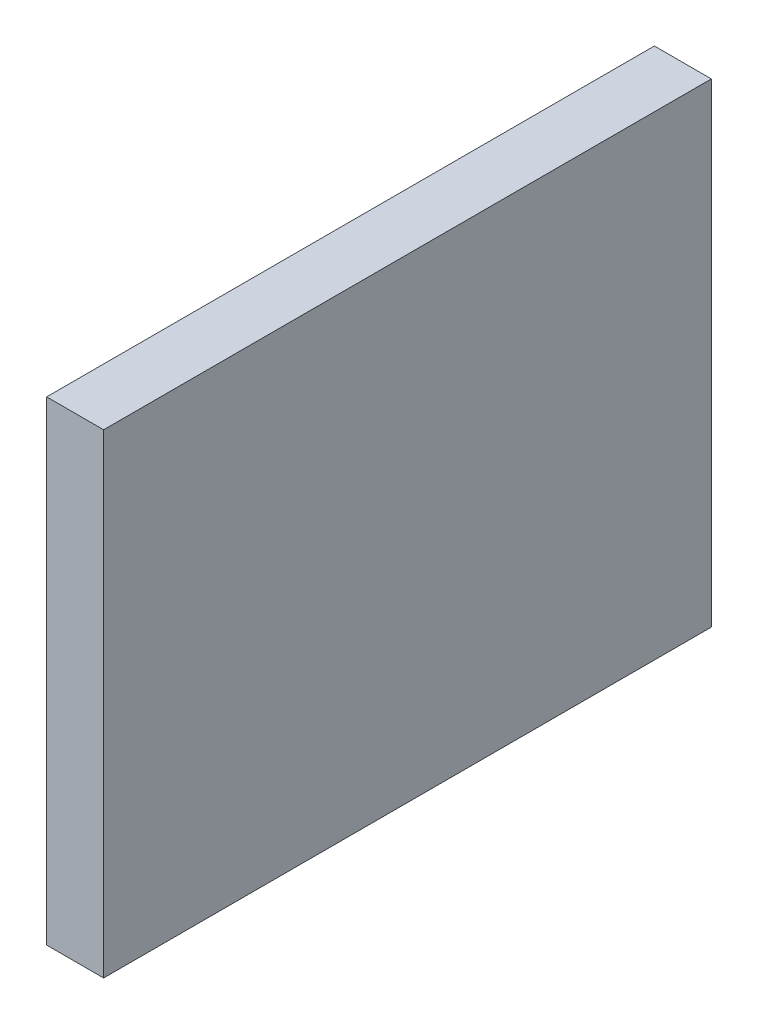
from build123d import *

# Parameters (mm, degrees)
SKETCH1_W           = 32.512
SKETCH1_H           = 25.4
BOSS_EXTRUDE1_DEPTH = 3.048


with BuildPart() as part:
    # Sketch1 → Boss-Extrude1 (new body)
    with BuildSketch(Plane(origin=(0, 0, 0), x_dir=(0, 0, -1), z_dir=(1, 0, 0))):
        with Locations((16.256, 12.7)):
            Rectangle(SKETCH1_W, SKETCH1_H)
    extrude(amount=BOSS_EXTRUDE1_DEPTH)


solid = part.part
